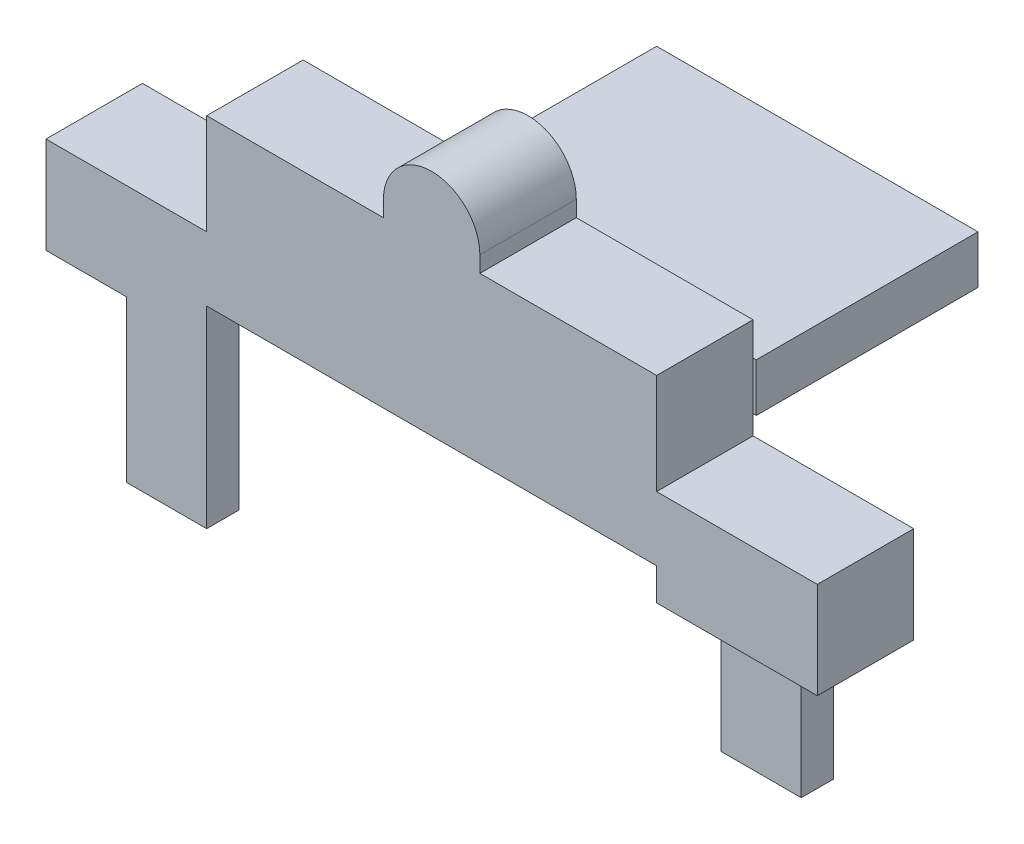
ISO-10303-21;
HEADER;
FILE_DESCRIPTION(('STEP AP214'),'2;1');
FILE_NAME('part.step','',(''),(''),'','','');
FILE_SCHEMA(('AUTOMOTIVE_DESIGN { 1 0 10303 214 1 1 1 1 }'));
ENDSEC;
DATA;
#1=APPLICATION_CONTEXT('core data for automotive mechanical design processes');
#2=APPLICATION_PROTOCOL_DEFINITION('international standard','automotive_design',2000,#1);
#3=PRODUCT_CONTEXT('',#1,'mechanical');
#4=PRODUCT('Part','Part','',(#3));
#5=PRODUCT_RELATED_PRODUCT_CATEGORY('part','',(#4));
#6=PRODUCT_DEFINITION_FORMATION('','',#4);
#7=PRODUCT_DEFINITION_CONTEXT('part definition',#1,'design');
#8=PRODUCT_DEFINITION('design','',#6,#7);
#9=PRODUCT_DEFINITION_SHAPE('','',#8);
#10=(LENGTH_UNIT() NAMED_UNIT(*) SI_UNIT(.MILLI.,.METRE.));
#11=(NAMED_UNIT(*) PLANE_ANGLE_UNIT() SI_UNIT($,.RADIAN.));
#12=(NAMED_UNIT(*) SI_UNIT($,.STERADIAN.) SOLID_ANGLE_UNIT());
#13=UNCERTAINTY_MEASURE_WITH_UNIT(LENGTH_MEASURE(1.E-05),#10,'distance_accuracy_value','');
#14=(GEOMETRIC_REPRESENTATION_CONTEXT(3) GLOBAL_UNCERTAINTY_ASSIGNED_CONTEXT((#13)) GLOBAL_UNIT_ASSIGNED_CONTEXT((#10,
#11,#12)) REPRESENTATION_CONTEXT('',''));
#15=CARTESIAN_POINT('',(0.,0.,0.));
#16=DIRECTION('',(0.,0.,1.));
#17=DIRECTION('',(1.,0.,0.));
#18=AXIS2_PLACEMENT_3D('',#15,#16,#17);
#19=CARTESIAN_POINT('',(0.,0.,0.));
#20=DIRECTION('',(0.,0.,1.));
#21=DIRECTION('',(1.,0.,0.));
#22=AXIS2_PLACEMENT_3D('',#19,#20,#21);
#23=PLANE('',#22);
#24=DIRECTION('',(0.,-1.,0.));
#25=VECTOR('',#24,1.);
#26=CARTESIAN_POINT('',(-9.85,10.,0.));
#27=LINE('',#26,#25);
#28=CARTESIAN_POINT('',(-9.85,2.,0.));
#29=VERTEX_POINT('',#28);
#30=CARTESIAN_POINT('',(-9.85,0.,0.));
#31=VERTEX_POINT('',#30);
#32=EDGE_CURVE('E50',#29,#31,#27,.T.);
#33=ORIENTED_EDGE('',*,*,#32,.T.);
#34=DIRECTION('',(-1.,0.,0.));
#35=VECTOR('',#34,1.);
#36=CARTESIAN_POINT('',(0.,0.,0.));
#37=LINE('',#36,#35);
#38=CARTESIAN_POINT('',(-14.,0.,0.));
#39=VERTEX_POINT('',#38);
#40=EDGE_CURVE('E261',#31,#39,#37,.T.);
#41=ORIENTED_EDGE('',*,*,#40,.T.);
#42=DIRECTION('',(0.,1.,0.));
#43=VECTOR('',#42,1.);
#44=CARTESIAN_POINT('',(-14.,-1.,0.));
#45=LINE('',#44,#43);
#46=CARTESIAN_POINT('',(-14.,-1.,0.));
#47=VERTEX_POINT('',#46);
#48=EDGE_CURVE('E380',#47,#39,#45,.T.);
#49=ORIENTED_EDGE('',*,*,#48,.F.);
#50=DIRECTION('',(1.,0.,0.));
#51=VECTOR('',#50,1.);
#52=CARTESIAN_POINT('',(0.,-1.,0.));
#53=LINE('',#52,#51);
#54=CARTESIAN_POINT('',(-19.,-1.,0.));
#55=VERTEX_POINT('',#54);
#56=EDGE_CURVE('E367',#55,#47,#53,.T.);
#57=ORIENTED_EDGE('',*,*,#56,.F.);
#58=DIRECTION('',(0.,1.,0.));
#59=VECTOR('',#58,1.);
#60=CARTESIAN_POINT('',(-19.,-1.,0.));
#61=LINE('',#60,#59);
#62=CARTESIAN_POINT('',(-19.,2.,0.));
#63=VERTEX_POINT('',#62);
#64=EDGE_CURVE('E383',#55,#63,#61,.T.);
#65=ORIENTED_EDGE('',*,*,#64,.T.);
#66=DIRECTION('',(1.,0.,0.));
#67=VECTOR('',#66,1.);
#68=CARTESIAN_POINT('',(0.,2.,0.));
#69=LINE('',#68,#67);
#70=CARTESIAN_POINT('',(-14.,2.,0.));
#71=VERTEX_POINT('',#70);
#72=EDGE_CURVE('E355',#63,#71,#69,.T.);
#73=ORIENTED_EDGE('',*,*,#72,.T.);
#74=DIRECTION('',(0.,1.,0.));
#75=VECTOR('',#74,1.);
#76=CARTESIAN_POINT('',(-14.,0.,0.));
#77=LINE('',#76,#75);
#78=CARTESIAN_POINT('',(-14.,5.13,0.));
#79=VERTEX_POINT('',#78);
#80=EDGE_CURVE('E429',#71,#79,#77,.T.);
#81=ORIENTED_EDGE('',*,*,#80,.T.);
#82=DIRECTION('',(1.,0.,0.));
#83=VECTOR('',#82,1.);
#84=CARTESIAN_POINT('',(0.,5.13,0.));
#85=LINE('',#84,#83);
#86=CARTESIAN_POINT('',(-8.5,5.13,0.));
#87=VERTEX_POINT('',#86);
#88=EDGE_CURVE('E421',#79,#87,#85,.T.);
#89=ORIENTED_EDGE('',*,*,#88,.T.);
#90=DIRECTION('',(0.,-1.,0.));
#91=VECTOR('',#90,1.);
#92=CARTESIAN_POINT('',(-8.5,0.,0.));
#93=LINE('',#92,#91);
#94=CARTESIAN_POINT('',(-8.5,5.63,0.));
#95=VERTEX_POINT('',#94);
#96=EDGE_CURVE('E426',#95,#87,#93,.T.);
#97=ORIENTED_EDGE('',*,*,#96,.F.);
#98=CARTESIAN_POINT('',(-7.,5.63,0.));
#99=DIRECTION('',(0.,0.,1.));
#100=DIRECTION('',(1.,0.,0.));
#101=AXIS2_PLACEMENT_3D('',#98,#99,#100);
#102=CIRCLE('',#101,1.5);
#103=CARTESIAN_POINT('',(-5.5,5.63,0.));
#104=VERTEX_POINT('',#103);
#105=EDGE_CURVE('E424',#104,#95,#102,.T.);
#106=ORIENTED_EDGE('',*,*,#105,.F.);
#107=DIRECTION('',(0.,-1.,0.));
#108=VECTOR('',#107,1.);
#109=CARTESIAN_POINT('',(-5.5,0.,0.));
#110=LINE('',#109,#108);
#111=CARTESIAN_POINT('',(-5.5,5.13,0.));
#112=VERTEX_POINT('',#111);
#113=EDGE_CURVE('E420',#104,#112,#110,.T.);
#114=ORIENTED_EDGE('',*,*,#113,.T.);
#115=CARTESIAN_POINT('',(0.,5.13,0.));
#116=VERTEX_POINT('',#115);
#117=EDGE_CURVE('E397',#112,#116,#85,.T.);
#118=ORIENTED_EDGE('',*,*,#117,.T.);
#119=DIRECTION('',(0.,-1.,0.));
#120=VECTOR('',#119,1.);
#121=CARTESIAN_POINT('',(0.,0.,0.));
#122=LINE('',#121,#120);
#123=CARTESIAN_POINT('',(0.,2.,0.));
#124=VERTEX_POINT('',#123);
#125=EDGE_CURVE('E404',#116,#124,#122,.T.);
#126=ORIENTED_EDGE('',*,*,#125,.T.);
#127=DIRECTION('',(1.,0.,0.));
#128=VECTOR('',#127,1.);
#129=CARTESIAN_POINT('',(0.,2.,0.));
#130=LINE('',#129,#128);
#131=CARTESIAN_POINT('',(5.,2.,0.));
#132=VERTEX_POINT('',#131);
#133=EDGE_CURVE('E329',#124,#132,#130,.T.);
#134=ORIENTED_EDGE('',*,*,#133,.T.);
#135=DIRECTION('',(0.,1.,0.));
#136=VECTOR('',#135,1.);
#137=CARTESIAN_POINT('',(5.,-0.999999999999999,0.));
#138=LINE('',#137,#136);
#139=CARTESIAN_POINT('',(5.,-0.999999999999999,0.));
#140=VERTEX_POINT('',#139);
#141=EDGE_CURVE('E342',#140,#132,#138,.T.);
#142=ORIENTED_EDGE('',*,*,#141,.F.);
#143=DIRECTION('',(1.,0.,0.));
#144=VECTOR('',#143,1.);
#145=CARTESIAN_POINT('',(0.,-1.,0.));
#146=LINE('',#145,#144);
#147=CARTESIAN_POINT('',(2.5,-1.,0.));
#148=VERTEX_POINT('',#147);
#149=EDGE_CURVE('E340',#148,#140,#146,.T.);
#150=ORIENTED_EDGE('',*,*,#149,.F.);
#151=DIRECTION('',(0.,1.,0.));
#152=VECTOR('',#151,1.);
#153=CARTESIAN_POINT('',(2.5,-6.,0.));
#154=LINE('',#153,#152);
#155=CARTESIAN_POINT('',(2.5,-6.,0.));
#156=VERTEX_POINT('',#155);
#157=EDGE_CURVE('E300',#156,#148,#154,.T.);
#158=ORIENTED_EDGE('',*,*,#157,.F.);
#159=DIRECTION('',(1.,0.,0.));
#160=VECTOR('',#159,1.);
#161=CARTESIAN_POINT('',(0.,-6.,0.));
#162=LINE('',#161,#160);
#163=CARTESIAN_POINT('',(0.,-6.,0.));
#164=VERTEX_POINT('',#163);
#165=EDGE_CURVE('E289',#164,#156,#162,.T.);
#166=ORIENTED_EDGE('',*,*,#165,.F.);
#167=DIRECTION('',(0.,1.,0.));
#168=VECTOR('',#167,1.);
#169=CARTESIAN_POINT('',(0.,-1.,0.));
#170=LINE('',#169,#168);
#171=CARTESIAN_POINT('',(0.,0.,0.));
#172=VERTEX_POINT('',#171);
#173=EDGE_CURVE('E344',#164,#172,#170,.T.);
#174=ORIENTED_EDGE('',*,*,#173,.T.);
#175=CARTESIAN_POINT('',(-4.15,0.,0.));
#176=VERTEX_POINT('',#175);
#177=EDGE_CURVE('E431',#172,#176,#37,.T.);
#178=ORIENTED_EDGE('',*,*,#177,.T.);
#179=DIRECTION('',(0.,-1.,0.));
#180=VECTOR('',#179,1.);
#181=CARTESIAN_POINT('',(-4.15,10.,0.));
#182=LINE('',#181,#180);
#183=CARTESIAN_POINT('',(-4.15,2.,0.));
#184=VERTEX_POINT('',#183);
#185=EDGE_CURVE('E58',#184,#176,#182,.T.);
#186=ORIENTED_EDGE('',*,*,#185,.F.);
#187=DIRECTION('',(1.,0.,0.));
#188=VECTOR('',#187,1.);
#189=CARTESIAN_POINT('',(0.,2.,0.));
#190=LINE('',#189,#188);
#191=EDGE_CURVE('E454',#29,#184,#190,.T.);
#192=ORIENTED_EDGE('',*,*,#191,.F.);
#193=EDGE_LOOP('',(#33,#41,#49,#57,#65,#73,#81,#89,#97,#106,#114,#118,#126,#134,#142,#150,#158,
#166,#174,#178,#186,#192));
#194=FACE_BOUND('',#193,.T.);
#195=ADVANCED_FACE('F35',(#194),#23,.F.);
#196=CARTESIAN_POINT('',(0.,0.5,0.));
#197=DIRECTION('',(0.,-1.,0.));
#198=DIRECTION('',(1.,0.,0.));
#199=AXIS2_PLACEMENT_3D('',#196,#197,#198);
#200=PLANE('',#199);
#201=DIRECTION('',(-1.,0.,0.));
#202=VECTOR('',#201,1.);
#203=CARTESIAN_POINT('',(-2.,0.5,-2.1));
#204=LINE('',#203,#202);
#205=CARTESIAN_POINT('',(-2.,0.5,-2.1));
#206=VERTEX_POINT('',#205);
#207=CARTESIAN_POINT('',(-4.15,0.5,-2.1));
#208=VERTEX_POINT('',#207);
#209=EDGE_CURVE('E272',#206,#208,#204,.T.);
#210=ORIENTED_EDGE('',*,*,#209,.T.);
#211=DIRECTION('',(1.,0.,0.));
#212=VECTOR('',#211,1.);
#213=CARTESIAN_POINT('',(-9.85,0.499999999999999,-2.1));
#214=LINE('',#213,#212);
#215=CARTESIAN_POINT('',(-9.85,0.499999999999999,-2.1));
#216=VERTEX_POINT('',#215);
#217=EDGE_CURVE('E257',#216,#208,#214,.T.);
#218=ORIENTED_EDGE('',*,*,#217,.F.);
#219=DIRECTION('',(-1.,0.,0.));
#220=VECTOR('',#219,1.);
#221=CARTESIAN_POINT('',(-12.,0.499999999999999,-2.1));
#222=LINE('',#221,#220);
#223=CARTESIAN_POINT('',(-12.,0.499999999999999,-2.1));
#224=VERTEX_POINT('',#223);
#225=EDGE_CURVE('E11',#216,#224,#222,.T.);
#226=ORIENTED_EDGE('',*,*,#225,.T.);
#227=DIRECTION('',(0.,0.,-1.));
#228=VECTOR('',#227,1.);
#229=CARTESIAN_POINT('',(-12.,0.499999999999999,0.));
#230=LINE('',#229,#228);
#231=CARTESIAN_POINT('',(-12.,0.499999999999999,-9.));
#232=VERTEX_POINT('',#231);
#233=EDGE_CURVE('E266',#224,#232,#230,.T.);
#234=ORIENTED_EDGE('',*,*,#233,.T.);
#235=DIRECTION('',(1.,0.,0.));
#236=VECTOR('',#235,1.);
#237=CARTESIAN_POINT('',(-12.,0.499999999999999,-9.));
#238=LINE('',#237,#236);
#239=CARTESIAN_POINT('',(-2.,0.5,-9.));
#240=VERTEX_POINT('',#239);
#241=EDGE_CURVE('E268',#232,#240,#238,.T.);
#242=ORIENTED_EDGE('',*,*,#241,.T.);
#243=DIRECTION('',(0.,0.,1.));
#244=VECTOR('',#243,1.);
#245=CARTESIAN_POINT('',(-2.,0.5,0.));
#246=LINE('',#245,#244);
#247=EDGE_CURVE('E270',#240,#206,#246,.T.);
#248=ORIENTED_EDGE('',*,*,#247,.T.);
#249=EDGE_LOOP('',(#210,#218,#226,#234,#242,#248));
#250=FACE_BOUND('',#249,.T.);
#251=ADVANCED_FACE('F502',(#250),#200,.T.);
#252=CARTESIAN_POINT('',(-12.,2.,3.));
#253=DIRECTION('',(-1.,0.,0.));
#254=DIRECTION('',(0.,-1.,0.));
#255=AXIS2_PLACEMENT_3D('',#252,#253,#254);
#256=PLANE('',#255);
#257=DIRECTION('',(0.,-1.,0.));
#258=VECTOR('',#257,1.);
#259=CARTESIAN_POINT('',(-12.,2.,-9.));
#260=LINE('',#259,#258);
#261=CARTESIAN_POINT('',(-12.,2.,-9.));
#262=VERTEX_POINT('',#261);
#263=EDGE_CURVE('E393',#262,#232,#260,.T.);
#264=ORIENTED_EDGE('',*,*,#263,.T.);
#265=ORIENTED_EDGE('',*,*,#233,.F.);
#266=DIRECTION('',(0.,-1.,0.));
#267=VECTOR('',#266,1.);
#268=CARTESIAN_POINT('',(-12.,10.,-2.1));
#269=LINE('',#268,#267);
#270=CARTESIAN_POINT('',(-12.,2.,-2.1));
#271=VERTEX_POINT('',#270);
#272=EDGE_CURVE('E277',#271,#224,#269,.T.);
#273=ORIENTED_EDGE('',*,*,#272,.F.);
#274=DIRECTION('',(0.,0.,-1.));
#275=VECTOR('',#274,1.);
#276=CARTESIAN_POINT('',(-12.,2.,3.));
#277=LINE('',#276,#275);
#278=EDGE_CURVE('E385',#271,#262,#277,.T.);
#279=ORIENTED_EDGE('',*,*,#278,.T.);
#280=EDGE_LOOP('',(#264,#265,#273,#279));
#281=FACE_BOUND('',#280,.T.);
#282=ADVANCED_FACE('F496',(#281),#256,.T.);
#283=CARTESIAN_POINT('',(-2.,2.,3.));
#284=DIRECTION('',(1.,0.,0.));
#285=DIRECTION('',(0.,1.,0.));
#286=AXIS2_PLACEMENT_3D('',#283,#284,#285);
#287=PLANE('',#286);
#288=DIRECTION('',(0.,-1.,0.));
#289=VECTOR('',#288,1.);
#290=CARTESIAN_POINT('',(-2.,10.,-2.1));
#291=LINE('',#290,#289);
#292=CARTESIAN_POINT('',(-2.,2.,-2.1));
#293=VERTEX_POINT('',#292);
#294=EDGE_CURVE('E280',#293,#206,#291,.T.);
#295=ORIENTED_EDGE('',*,*,#294,.T.);
#296=ORIENTED_EDGE('',*,*,#247,.F.);
#297=DIRECTION('',(0.,-1.,0.));
#298=VECTOR('',#297,1.);
#299=CARTESIAN_POINT('',(-2.,2.,-9.));
#300=LINE('',#299,#298);
#301=CARTESIAN_POINT('',(-2.,2.,-9.));
#302=VERTEX_POINT('',#301);
#303=EDGE_CURVE('E394',#302,#240,#300,.T.);
#304=ORIENTED_EDGE('',*,*,#303,.F.);
#305=DIRECTION('',(0.,0.,1.));
#306=VECTOR('',#305,1.);
#307=CARTESIAN_POINT('',(-2.,2.,3.));
#308=LINE('',#307,#306);
#309=EDGE_CURVE('E390',#302,#293,#308,.T.);
#310=ORIENTED_EDGE('',*,*,#309,.T.);
#311=EDGE_LOOP('',(#295,#296,#304,#310));
#312=FACE_BOUND('',#311,.T.);
#313=ADVANCED_FACE('F488',(#312),#287,.T.);
#314=CARTESIAN_POINT('',(-12.,2.,-9.));
#315=DIRECTION('',(0.,0.,-1.));
#316=DIRECTION('',(-1.,0.,0.));
#317=AXIS2_PLACEMENT_3D('',#314,#315,#316);
#318=PLANE('',#317);
#319=ORIENTED_EDGE('',*,*,#303,.T.);
#320=ORIENTED_EDGE('',*,*,#241,.F.);
#321=ORIENTED_EDGE('',*,*,#263,.F.);
#322=DIRECTION('',(1.,0.,0.));
#323=VECTOR('',#322,1.);
#324=CARTESIAN_POINT('',(-12.,2.,-9.));
#325=LINE('',#324,#323);
#326=EDGE_CURVE('E387',#262,#302,#325,.T.);
#327=ORIENTED_EDGE('',*,*,#326,.T.);
#328=EDGE_LOOP('',(#319,#320,#321,#327));
#329=FACE_BOUND('',#328,.T.);
#330=ADVANCED_FACE('F492',(#329),#318,.T.);
#331=CARTESIAN_POINT('',(-2.,10.,-2.1));
#332=DIRECTION('',(0.,0.,-1.));
#333=DIRECTION('',(-1.,0.,0.));
#334=AXIS2_PLACEMENT_3D('',#331,#332,#333);
#335=PLANE('',#334);
#336=ORIENTED_EDGE('',*,*,#209,.F.);
#337=ORIENTED_EDGE('',*,*,#294,.F.);
#338=DIRECTION('',(1.,0.,0.));
#339=VECTOR('',#338,1.);
#340=CARTESIAN_POINT('',(0.,2.,-2.1));
#341=LINE('',#340,#339);
#342=CARTESIAN_POINT('',(-4.15,2.,-2.1));
#343=VERTEX_POINT('',#342);
#344=EDGE_CURVE('E472',#343,#293,#341,.T.);
#345=ORIENTED_EDGE('',*,*,#344,.F.);
#346=DIRECTION('',(0.,-1.,0.));
#347=VECTOR('',#346,1.);
#348=CARTESIAN_POINT('',(-4.15,10.,-2.1));
#349=LINE('',#348,#347);
#350=EDGE_CURVE('E283',#343,#208,#349,.T.);
#351=ORIENTED_EDGE('',*,*,#350,.T.);
#352=EDGE_LOOP('',(#336,#337,#345,#351));
#353=FACE_BOUND('',#352,.T.);
#354=ADVANCED_FACE('F658',(#353),#335,.F.);
#355=CARTESIAN_POINT('',(-4.15,10.,0.));
#356=DIRECTION('',(-1.,0.,0.));
#357=DIRECTION('',(0.,-1.,0.));
#358=AXIS2_PLACEMENT_3D('',#355,#356,#357);
#359=PLANE('',#358);
#360=ORIENTED_EDGE('',*,*,#185,.T.);
#361=DIRECTION('',(0.,0.,1.));
#362=VECTOR('',#361,1.);
#363=CARTESIAN_POINT('',(-4.15,0.,0.));
#364=LINE('',#363,#362);
#365=CARTESIAN_POINT('',(-4.15,0.,-2.1));
#366=VERTEX_POINT('',#365);
#367=EDGE_CURVE('E248',#366,#176,#364,.T.);
#368=ORIENTED_EDGE('',*,*,#367,.F.);
#369=DIRECTION('',(0.,1.,0.));
#370=VECTOR('',#369,1.);
#371=CARTESIAN_POINT('',(-4.15,-6.07453701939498,-2.1));
#372=LINE('',#371,#370);
#373=EDGE_CURVE('E244',#366,#208,#372,.T.);
#374=ORIENTED_EDGE('',*,*,#373,.T.);
#375=ORIENTED_EDGE('',*,*,#350,.F.);
#376=DIRECTION('',(0.,0.,-1.));
#377=VECTOR('',#376,1.);
#378=CARTESIAN_POINT('',(-4.15,2.,0.));
#379=LINE('',#378,#377);
#380=EDGE_CURVE('E469',#184,#343,#379,.T.);
#381=ORIENTED_EDGE('',*,*,#380,.F.);
#382=EDGE_LOOP('',(#360,#368,#374,#375,#381));
#383=FACE_BOUND('',#382,.T.);
#384=ADVANCED_FACE('F483',(#383),#359,.F.);
#385=CARTESIAN_POINT('',(-9.85,10.,0.));
#386=DIRECTION('',(1.,0.,0.));
#387=DIRECTION('',(0.,1.,0.));
#388=AXIS2_PLACEMENT_3D('',#385,#386,#387);
#389=PLANE('',#388);
#390=DIRECTION('',(0.,-1.,0.));
#391=VECTOR('',#390,1.);
#392=CARTESIAN_POINT('',(-9.85,10.,-2.1));
#393=LINE('',#392,#391);
#394=CARTESIAN_POINT('',(-9.85,2.,-2.1));
#395=VERTEX_POINT('',#394);
#396=EDGE_CURVE('E256',#395,#216,#393,.T.);
#397=ORIENTED_EDGE('',*,*,#396,.T.);
#398=DIRECTION('',(0.,1.,0.));
#399=VECTOR('',#398,1.);
#400=CARTESIAN_POINT('',(-9.85,-6.07453701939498,-2.1));
#401=LINE('',#400,#399);
#402=CARTESIAN_POINT('',(-9.85,0.,-2.1));
#403=VERTEX_POINT('',#402);
#404=EDGE_CURVE('E242',#403,#216,#401,.T.);
#405=ORIENTED_EDGE('',*,*,#404,.F.);
#406=DIRECTION('',(0.,0.,-1.));
#407=VECTOR('',#406,1.);
#408=CARTESIAN_POINT('',(-9.85,0.,0.));
#409=LINE('',#408,#407);
#410=EDGE_CURVE('E249',#31,#403,#409,.T.);
#411=ORIENTED_EDGE('',*,*,#410,.F.);
#412=ORIENTED_EDGE('',*,*,#32,.F.);
#413=DIRECTION('',(0.,0.,1.));
#414=VECTOR('',#413,1.);
#415=CARTESIAN_POINT('',(-9.85,2.,0.));
#416=LINE('',#415,#414);
#417=EDGE_CURVE('E43',#395,#29,#416,.T.);
#418=ORIENTED_EDGE('',*,*,#417,.F.);
#419=EDGE_LOOP('',(#397,#405,#411,#412,#418));
#420=FACE_BOUND('',#419,.T.);
#421=ADVANCED_FACE('F254',(#420),#389,.F.);
#422=CARTESIAN_POINT('',(-12.,10.,-2.1));
#423=DIRECTION('',(0.,0.,-1.));
#424=DIRECTION('',(-1.,0.,0.));
#425=AXIS2_PLACEMENT_3D('',#422,#423,#424);
#426=PLANE('',#425);
#427=ORIENTED_EDGE('',*,*,#225,.F.);
#428=ORIENTED_EDGE('',*,*,#396,.F.);
#429=DIRECTION('',(1.,0.,0.));
#430=VECTOR('',#429,1.);
#431=CARTESIAN_POINT('',(0.,2.,-2.1));
#432=LINE('',#431,#430);
#433=EDGE_CURVE('E475',#271,#395,#432,.T.);
#434=ORIENTED_EDGE('',*,*,#433,.F.);
#435=ORIENTED_EDGE('',*,*,#272,.T.);
#436=EDGE_LOOP('',(#427,#428,#434,#435));
#437=FACE_BOUND('',#436,.T.);
#438=ADVANCED_FACE('F500',(#437),#426,.F.);
#439=CARTESIAN_POINT('',(0.,-1.,0.));
#440=DIRECTION('',(0.,-1.,0.));
#441=DIRECTION('',(1.,0.,0.));
#442=AXIS2_PLACEMENT_3D('',#439,#440,#441);
#443=PLANE('',#442);
#444=DIRECTION('',(1.,0.,0.));
#445=VECTOR('',#444,1.);
#446=CARTESIAN_POINT('',(0.,-1.,1.));
#447=LINE('',#446,#445);
#448=CARTESIAN_POINT('',(0.,-1.,1.));
#449=VERTEX_POINT('',#448);
#450=CARTESIAN_POINT('',(2.5,-1.,1.));
#451=VERTEX_POINT('',#450);
#452=EDGE_CURVE('E463',#449,#451,#447,.T.);
#453=ORIENTED_EDGE('',*,*,#452,.T.);
#454=DIRECTION('',(0.,0.,-1.));
#455=VECTOR('',#454,1.);
#456=CARTESIAN_POINT('',(2.5,-1.,0.));
#457=LINE('',#456,#455);
#458=EDGE_CURVE('E466',#451,#148,#457,.T.);
#459=ORIENTED_EDGE('',*,*,#458,.T.);
#460=ORIENTED_EDGE('',*,*,#149,.T.);
#461=DIRECTION('',(0.,0.,-1.));
#462=VECTOR('',#461,1.);
#463=CARTESIAN_POINT('',(5.,-0.999999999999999,0.));
#464=LINE('',#463,#462);
#465=CARTESIAN_POINT('',(5.,-0.999999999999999,3.));
#466=VERTEX_POINT('',#465);
#467=EDGE_CURVE('E332',#466,#140,#464,.T.);
#468=ORIENTED_EDGE('',*,*,#467,.F.);
#469=DIRECTION('',(1.,0.,0.));
#470=VECTOR('',#469,1.);
#471=CARTESIAN_POINT('',(0.,-1.,3.));
#472=LINE('',#471,#470);
#473=CARTESIAN_POINT('',(0.,-1.,3.));
#474=VERTEX_POINT('',#473);
#475=EDGE_CURVE('E335',#474,#466,#472,.T.);
#476=ORIENTED_EDGE('',*,*,#475,.F.);
#477=DIRECTION('',(0.,0.,1.));
#478=VECTOR('',#477,1.);
#479=CARTESIAN_POINT('',(0.,-1.,0.));
#480=LINE('',#479,#478);
#481=EDGE_CURVE('E338',#449,#474,#480,.T.);
#482=ORIENTED_EDGE('',*,*,#481,.F.);
#483=EDGE_LOOP('',(#453,#459,#460,#468,#476,#482));
#484=FACE_BOUND('',#483,.T.);
#485=ADVANCED_FACE('F518',(#484),#443,.T.);
#486=CARTESIAN_POINT('',(0.,-1.,0.));
#487=DIRECTION('',(0.,-1.,0.));
#488=DIRECTION('',(1.,0.,0.));
#489=AXIS2_PLACEMENT_3D('',#486,#487,#488);
#490=PLANE('',#489);
#491=DIRECTION('',(-1.,0.,0.));
#492=VECTOR('',#491,1.);
#493=CARTESIAN_POINT('',(0.,-1.,2.));
#494=LINE('',#493,#492);
#495=CARTESIAN_POINT('',(-14.,-1.,2.));
#496=VERTEX_POINT('',#495);
#497=CARTESIAN_POINT('',(-16.5,-1.,2.));
#498=VERTEX_POINT('',#497);
#499=EDGE_CURVE('E457',#496,#498,#494,.T.);
#500=ORIENTED_EDGE('',*,*,#499,.T.);
#501=DIRECTION('',(0.,0.,1.));
#502=VECTOR('',#501,1.);
#503=CARTESIAN_POINT('',(-16.5,-1.,0.));
#504=LINE('',#503,#502);
#505=CARTESIAN_POINT('',(-16.5,-1.,3.));
#506=VERTEX_POINT('',#505);
#507=EDGE_CURVE('E460',#498,#506,#504,.T.);
#508=ORIENTED_EDGE('',*,*,#507,.T.);
#509=DIRECTION('',(1.,0.,0.));
#510=VECTOR('',#509,1.);
#511=CARTESIAN_POINT('',(0.,-1.,3.));
#512=LINE('',#511,#510);
#513=CARTESIAN_POINT('',(-19.,-1.,3.));
#514=VERTEX_POINT('',#513);
#515=EDGE_CURVE('E372',#514,#506,#512,.T.);
#516=ORIENTED_EDGE('',*,*,#515,.F.);
#517=DIRECTION('',(0.,0.,-1.));
#518=VECTOR('',#517,1.);
#519=CARTESIAN_POINT('',(-19.,-1.,0.));
#520=LINE('',#519,#518);
#521=EDGE_CURVE('E364',#514,#55,#520,.T.);
#522=ORIENTED_EDGE('',*,*,#521,.T.);
#523=ORIENTED_EDGE('',*,*,#56,.T.);
#524=DIRECTION('',(0.,0.,-1.));
#525=VECTOR('',#524,1.);
#526=CARTESIAN_POINT('',(-14.,-1.,0.));
#527=LINE('',#526,#525);
#528=EDGE_CURVE('E370',#496,#47,#527,.T.);
#529=ORIENTED_EDGE('',*,*,#528,.F.);
#530=EDGE_LOOP('',(#500,#508,#516,#522,#523,#529));
#531=FACE_BOUND('',#530,.T.);
#532=ADVANCED_FACE('F572',(#531),#490,.T.);
#533=CARTESIAN_POINT('',(0.,5.13,3.));
#534=DIRECTION('',(0.,1.,0.));
#535=DIRECTION('',(-1.,0.,0.));
#536=AXIS2_PLACEMENT_3D('',#533,#534,#535);
#537=PLANE('',#536);
#538=ORIENTED_EDGE('',*,*,#117,.F.);
#539=DIRECTION('',(0.,0.,-1.));
#540=VECTOR('',#539,1.);
#541=CARTESIAN_POINT('',(-5.5,5.13,3.));
#542=LINE('',#541,#540);
#543=CARTESIAN_POINT('',(-5.5,5.13,3.));
#544=VERTEX_POINT('',#543);
#545=EDGE_CURVE('E452',#544,#112,#542,.T.);
#546=ORIENTED_EDGE('',*,*,#545,.F.);
#547=DIRECTION('',(1.,0.,0.));
#548=VECTOR('',#547,1.);
#549=CARTESIAN_POINT('',(0.,5.13,3.));
#550=LINE('',#549,#548);
#551=CARTESIAN_POINT('',(0.,5.13,3.));
#552=VERTEX_POINT('',#551);
#553=EDGE_CURVE('E400',#544,#552,#550,.T.);
#554=ORIENTED_EDGE('',*,*,#553,.T.);
#555=DIRECTION('',(0.,0.,-1.));
#556=VECTOR('',#555,1.);
#557=CARTESIAN_POINT('',(0.,5.13,3.));
#558=LINE('',#557,#556);
#559=EDGE_CURVE('E418',#552,#116,#558,.T.);
#560=ORIENTED_EDGE('',*,*,#559,.T.);
#561=EDGE_LOOP('',(#538,#546,#554,#560));
#562=FACE_BOUND('',#561,.T.);
#563=ADVANCED_FACE('F536',(#562),#537,.T.);
#564=CARTESIAN_POINT('',(-5.5,0.,3.));
#565=DIRECTION('',(1.,0.,0.));
#566=DIRECTION('',(0.,0.,-1.));
#567=AXIS2_PLACEMENT_3D('',#564,#565,#566);
#568=PLANE('',#567);
#569=ORIENTED_EDGE('',*,*,#113,.F.);
#570=DIRECTION('',(0.,0.,-1.));
#571=VECTOR('',#570,1.);
#572=CARTESIAN_POINT('',(-5.5,5.63,3.));
#573=LINE('',#572,#571);
#574=CARTESIAN_POINT('',(-5.5,5.63,3.));
#575=VERTEX_POINT('',#574);
#576=EDGE_CURVE('E450',#575,#104,#573,.T.);
#577=ORIENTED_EDGE('',*,*,#576,.F.);
#578=DIRECTION('',(0.,-1.,0.));
#579=VECTOR('',#578,1.);
#580=CARTESIAN_POINT('',(-5.5,0.,3.));
#581=LINE('',#580,#579);
#582=EDGE_CURVE('E403',#575,#544,#581,.T.);
#583=ORIENTED_EDGE('',*,*,#582,.T.);
#584=ORIENTED_EDGE('',*,*,#545,.T.);
#585=EDGE_LOOP('',(#569,#577,#583,#584));
#586=FACE_BOUND('',#585,.T.);
#587=ADVANCED_FACE('F37',(#586),#568,.T.);
#588=CARTESIAN_POINT('',(-7.,5.63,3.));
#589=DIRECTION('',(0.,0.,-1.));
#590=DIRECTION('',(-1.,0.,0.));
#591=AXIS2_PLACEMENT_3D('',#588,#589,#590);
#592=CYLINDRICAL_SURFACE('',#591,1.5);
#593=ORIENTED_EDGE('',*,*,#105,.T.);
#594=DIRECTION('',(0.,0.,-1.));
#595=VECTOR('',#594,1.);
#596=CARTESIAN_POINT('',(-8.5,5.63,3.));
#597=LINE('',#596,#595);
#598=CARTESIAN_POINT('',(-8.5,5.63,3.));
#599=VERTEX_POINT('',#598);
#600=EDGE_CURVE('E447',#599,#95,#597,.T.);
#601=ORIENTED_EDGE('',*,*,#600,.F.);
#602=CARTESIAN_POINT('',(-7.,5.63,3.));
#603=DIRECTION('',(0.,0.,1.));
#604=DIRECTION('',(1.,0.,0.));
#605=AXIS2_PLACEMENT_3D('',#602,#603,#604);
#606=CIRCLE('',#605,1.5);
#607=EDGE_CURVE('E408',#575,#599,#606,.T.);
#608=ORIENTED_EDGE('',*,*,#607,.F.);
#609=ORIENTED_EDGE('',*,*,#576,.T.);
#610=EDGE_LOOP('',(#593,#601,#608,#609));
#611=FACE_BOUND('',#610,.T.);
#612=ADVANCED_FACE('F543',(#611),#592,.T.);
#613=CARTESIAN_POINT('',(-8.5,0.,3.));
#614=DIRECTION('',(1.,0.,0.));
#615=DIRECTION('',(0.,0.,-1.));
#616=AXIS2_PLACEMENT_3D('',#613,#614,#615);
#617=PLANE('',#616);
#618=ORIENTED_EDGE('',*,*,#96,.T.);
#619=DIRECTION('',(0.,0.,-1.));
#620=VECTOR('',#619,1.);
#621=CARTESIAN_POINT('',(-8.5,5.13,3.));
#622=LINE('',#621,#620);
#623=CARTESIAN_POINT('',(-8.5,5.13,3.));
#624=VERTEX_POINT('',#623);
#625=EDGE_CURVE('E444',#624,#87,#622,.T.);
#626=ORIENTED_EDGE('',*,*,#625,.F.);
#627=DIRECTION('',(0.,-1.,0.));
#628=VECTOR('',#627,1.);
#629=CARTESIAN_POINT('',(-8.5,0.,3.));
#630=LINE('',#629,#628);
#631=EDGE_CURVE('E410',#599,#624,#630,.T.);
#632=ORIENTED_EDGE('',*,*,#631,.F.);
#633=ORIENTED_EDGE('',*,*,#600,.T.);
#634=EDGE_LOOP('',(#618,#626,#632,#633));
#635=FACE_BOUND('',#634,.T.);
#636=ADVANCED_FACE('F550',(#635),#617,.F.);
#637=ORIENTED_EDGE('',*,*,#88,.F.);
#638=DIRECTION('',(0.,0.,-1.));
#639=VECTOR('',#638,1.);
#640=CARTESIAN_POINT('',(-14.,5.13,3.));
#641=LINE('',#640,#639);
#642=CARTESIAN_POINT('',(-14.,5.13,3.));
#643=VERTEX_POINT('',#642);
#644=EDGE_CURVE('E441',#643,#79,#641,.T.);
#645=ORIENTED_EDGE('',*,*,#644,.F.);
#646=EDGE_CURVE('E405',#643,#624,#550,.T.);
#647=ORIENTED_EDGE('',*,*,#646,.T.);
#648=ORIENTED_EDGE('',*,*,#625,.T.);
#649=EDGE_LOOP('',(#637,#645,#647,#648));
#650=FACE_BOUND('',#649,.T.);
#651=ADVANCED_FACE('F555',(#650),#537,.T.);
#652=CARTESIAN_POINT('',(-14.,0.,3.));
#653=DIRECTION('',(-1.,0.,0.));
#654=DIRECTION('',(0.,0.,1.));
#655=AXIS2_PLACEMENT_3D('',#652,#653,#654);
#656=PLANE('',#655);
#657=DIRECTION('',(0.,0.,-1.));
#658=VECTOR('',#657,1.);
#659=CARTESIAN_POINT('',(-14.,2.,0.));
#660=LINE('',#659,#658);
#661=CARTESIAN_POINT('',(-14.,2.,3.));
#662=VERTEX_POINT('',#661);
#663=EDGE_CURVE('E358',#662,#71,#660,.T.);
#664=ORIENTED_EDGE('',*,*,#663,.F.);
#665=DIRECTION('',(0.,1.,0.));
#666=VECTOR('',#665,1.);
#667=CARTESIAN_POINT('',(-14.,0.,3.));
#668=LINE('',#667,#666);
#669=EDGE_CURVE('E412',#662,#643,#668,.T.);
#670=ORIENTED_EDGE('',*,*,#669,.T.);
#671=ORIENTED_EDGE('',*,*,#644,.T.);
#672=ORIENTED_EDGE('',*,*,#80,.F.);
#673=EDGE_LOOP('',(#664,#670,#671,#672));
#674=FACE_BOUND('',#673,.T.);
#675=ADVANCED_FACE('F557',(#674),#656,.T.);
#676=CARTESIAN_POINT('',(0.,0.,3.));
#677=DIRECTION('',(0.,-1.,0.));
#678=DIRECTION('',(1.,0.,0.));
#679=AXIS2_PLACEMENT_3D('',#676,#677,#678);
#680=PLANE('',#679);
#681=DIRECTION('',(0.,0.,-1.));
#682=VECTOR('',#681,1.);
#683=CARTESIAN_POINT('',(-14.,0.,3.));
#684=LINE('',#683,#682);
#685=CARTESIAN_POINT('',(-14.,0.,3.));
#686=VERTEX_POINT('',#685);
#687=EDGE_CURVE('E439',#686,#39,#684,.T.);
#688=ORIENTED_EDGE('',*,*,#687,.T.);
#689=ORIENTED_EDGE('',*,*,#40,.F.);
#690=ORIENTED_EDGE('',*,*,#410,.T.);
#691=DIRECTION('',(1.,0.,0.));
#692=VECTOR('',#691,1.);
#693=CARTESIAN_POINT('',(-9.85,0.,-2.1));
#694=LINE('',#693,#692);
#695=EDGE_CURVE('E238',#403,#366,#694,.T.);
#696=ORIENTED_EDGE('',*,*,#695,.T.);
#697=ORIENTED_EDGE('',*,*,#367,.T.);
#698=ORIENTED_EDGE('',*,*,#177,.F.);
#699=DIRECTION('',(0.,0.,-1.));
#700=VECTOR('',#699,1.);
#701=CARTESIAN_POINT('',(0.,0.,3.));
#702=LINE('',#701,#700);
#703=CARTESIAN_POINT('',(0.,0.,3.));
#704=VERTEX_POINT('',#703);
#705=EDGE_CURVE('E437',#704,#172,#702,.T.);
#706=ORIENTED_EDGE('',*,*,#705,.F.);
#707=DIRECTION('',(-1.,0.,0.));
#708=VECTOR('',#707,1.);
#709=CARTESIAN_POINT('',(0.,0.,3.));
#710=LINE('',#709,#708);
#711=EDGE_CURVE('E414',#704,#686,#710,.T.);
#712=ORIENTED_EDGE('',*,*,#711,.T.);
#713=EDGE_LOOP('',(#688,#689,#690,#696,#697,#698,#706,#712));
#714=FACE_BOUND('',#713,.T.);
#715=ADVANCED_FACE('F260',(#714),#680,.T.);
#716=CARTESIAN_POINT('',(0.,0.,3.));
#717=DIRECTION('',(1.,0.,0.));
#718=DIRECTION('',(0.,1.,0.));
#719=AXIS2_PLACEMENT_3D('',#716,#717,#718);
#720=PLANE('',#719);
#721=DIRECTION('',(0.,0.,1.));
#722=VECTOR('',#721,1.);
#723=CARTESIAN_POINT('',(0.,2.,0.));
#724=LINE('',#723,#722);
#725=CARTESIAN_POINT('',(0.,2.,3.));
#726=VERTEX_POINT('',#725);
#727=EDGE_CURVE('E326',#124,#726,#724,.T.);
#728=ORIENTED_EDGE('',*,*,#727,.F.);
#729=ORIENTED_EDGE('',*,*,#125,.F.);
#730=ORIENTED_EDGE('',*,*,#559,.F.);
#731=DIRECTION('',(0.,-1.,0.));
#732=VECTOR('',#731,1.);
#733=CARTESIAN_POINT('',(0.,0.,3.));
#734=LINE('',#733,#732);
#735=EDGE_CURVE('E416',#552,#726,#734,.T.);
#736=ORIENTED_EDGE('',*,*,#735,.T.);
#737=EDGE_LOOP('',(#728,#729,#730,#736));
#738=FACE_BOUND('',#737,.T.);
#739=ADVANCED_FACE('F531',(#738),#720,.T.);
#740=CARTESIAN_POINT('',(0.,0.,3.));
#741=DIRECTION('',(0.,0.,1.));
#742=DIRECTION('',(1.,0.,0.));
#743=AXIS2_PLACEMENT_3D('',#740,#741,#742);
#744=PLANE('',#743);
#745=ORIENTED_EDGE('',*,*,#515,.T.);
#746=DIRECTION('',(0.,1.,0.));
#747=VECTOR('',#746,1.);
#748=CARTESIAN_POINT('',(-16.5,-6.,3.));
#749=LINE('',#748,#747);
#750=CARTESIAN_POINT('',(-16.5,-6.,3.));
#751=VERTEX_POINT('',#750);
#752=EDGE_CURVE('E312',#751,#506,#749,.T.);
#753=ORIENTED_EDGE('',*,*,#752,.F.);
#754=DIRECTION('',(-1.,0.,0.));
#755=VECTOR('',#754,1.);
#756=CARTESIAN_POINT('',(-16.5,-6.,3.));
#757=LINE('',#756,#755);
#758=CARTESIAN_POINT('',(-14.,-6.,3.));
#759=VERTEX_POINT('',#758);
#760=EDGE_CURVE('E310',#759,#751,#757,.T.);
#761=ORIENTED_EDGE('',*,*,#760,.F.);
#762=DIRECTION('',(0.,1.,0.));
#763=VECTOR('',#762,1.);
#764=CARTESIAN_POINT('',(-14.,-1.,3.));
#765=LINE('',#764,#763);
#766=EDGE_CURVE('E377',#759,#686,#765,.T.);
#767=ORIENTED_EDGE('',*,*,#766,.T.);
#768=ORIENTED_EDGE('',*,*,#711,.F.);
#769=DIRECTION('',(0.,1.,0.));
#770=VECTOR('',#769,1.);
#771=CARTESIAN_POINT('',(0.,-1.,3.));
#772=LINE('',#771,#770);
#773=EDGE_CURVE('E347',#474,#704,#772,.T.);
#774=ORIENTED_EDGE('',*,*,#773,.F.);
#775=ORIENTED_EDGE('',*,*,#475,.T.);
#776=DIRECTION('',(0.,1.,0.));
#777=VECTOR('',#776,1.);
#778=CARTESIAN_POINT('',(5.,-0.999999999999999,3.));
#779=LINE('',#778,#777);
#780=CARTESIAN_POINT('',(5.,2.,3.));
#781=VERTEX_POINT('',#780);
#782=EDGE_CURVE('E350',#466,#781,#779,.T.);
#783=ORIENTED_EDGE('',*,*,#782,.T.);
#784=DIRECTION('',(1.,0.,0.));
#785=VECTOR('',#784,1.);
#786=CARTESIAN_POINT('',(0.,2.,3.));
#787=LINE('',#786,#785);
#788=EDGE_CURVE('E323',#726,#781,#787,.T.);
#789=ORIENTED_EDGE('',*,*,#788,.F.);
#790=ORIENTED_EDGE('',*,*,#735,.F.);
#791=ORIENTED_EDGE('',*,*,#553,.F.);
#792=ORIENTED_EDGE('',*,*,#582,.F.);
#793=ORIENTED_EDGE('',*,*,#607,.T.);
#794=ORIENTED_EDGE('',*,*,#631,.T.);
#795=ORIENTED_EDGE('',*,*,#646,.F.);
#796=ORIENTED_EDGE('',*,*,#669,.F.);
#797=DIRECTION('',(1.,0.,0.));
#798=VECTOR('',#797,1.);
#799=CARTESIAN_POINT('',(0.,2.,3.));
#800=LINE('',#799,#798);
#801=CARTESIAN_POINT('',(-19.,2.,3.));
#802=VERTEX_POINT('',#801);
#803=EDGE_CURVE('E361',#802,#662,#800,.T.);
#804=ORIENTED_EDGE('',*,*,#803,.F.);
#805=DIRECTION('',(0.,1.,0.));
#806=VECTOR('',#805,1.);
#807=CARTESIAN_POINT('',(-19.,-1.,3.));
#808=LINE('',#807,#806);
#809=EDGE_CURVE('E375',#514,#802,#808,.T.);
#810=ORIENTED_EDGE('',*,*,#809,.F.);
#811=EDGE_LOOP('',(#745,#753,#761,#767,#768,#774,#775,#783,#789,#790,#791,#792,#793,#794,#795,
#796,#804,#810));
#812=FACE_BOUND('',#811,.T.);
#813=ADVANCED_FACE('F515',(#812),#744,.T.);
#814=CARTESIAN_POINT('',(0.,2.,0.));
#815=DIRECTION('',(0.,-1.,0.));
#816=DIRECTION('',(1.,0.,0.));
#817=AXIS2_PLACEMENT_3D('',#814,#815,#816);
#818=PLANE('',#817);
#819=ORIENTED_EDGE('',*,*,#433,.T.);
#820=ORIENTED_EDGE('',*,*,#417,.T.);
#821=ORIENTED_EDGE('',*,*,#191,.T.);
#822=ORIENTED_EDGE('',*,*,#380,.T.);
#823=ORIENTED_EDGE('',*,*,#344,.T.);
#824=ORIENTED_EDGE('',*,*,#309,.F.);
#825=ORIENTED_EDGE('',*,*,#326,.F.);
#826=ORIENTED_EDGE('',*,*,#278,.F.);
#827=EDGE_LOOP('',(#819,#820,#821,#822,#823,#824,#825,#826));
#828=FACE_BOUND('',#827,.T.);
#829=ADVANCED_FACE('F479',(#828),#818,.F.);
#830=CARTESIAN_POINT('',(-14.,-1.,0.));
#831=DIRECTION('',(1.,0.,0.));
#832=DIRECTION('',(0.,1.,0.));
#833=AXIS2_PLACEMENT_3D('',#830,#831,#832);
#834=PLANE('',#833);
#835=DIRECTION('',(0.,1.,0.));
#836=VECTOR('',#835,1.);
#837=CARTESIAN_POINT('',(-14.,-6.,2.));
#838=LINE('',#837,#836);
#839=CARTESIAN_POINT('',(-14.,-6.,2.));
#840=VERTEX_POINT('',#839);
#841=EDGE_CURVE('E314',#840,#496,#838,.T.);
#842=ORIENTED_EDGE('',*,*,#841,.T.);
#843=ORIENTED_EDGE('',*,*,#528,.T.);
#844=ORIENTED_EDGE('',*,*,#48,.T.);
#845=ORIENTED_EDGE('',*,*,#687,.F.);
#846=ORIENTED_EDGE('',*,*,#766,.F.);
#847=DIRECTION('',(0.,0.,1.));
#848=VECTOR('',#847,1.);
#849=CARTESIAN_POINT('',(-14.,-6.,3.));
#850=LINE('',#849,#848);
#851=EDGE_CURVE('E307',#840,#759,#850,.T.);
#852=ORIENTED_EDGE('',*,*,#851,.F.);
#853=EDGE_LOOP('',(#842,#843,#844,#845,#846,#852));
#854=FACE_BOUND('',#853,.T.);
#855=ADVANCED_FACE('F585',(#854),#834,.T.);
#856=CARTESIAN_POINT('',(-19.,-1.,0.));
#857=DIRECTION('',(1.,0.,0.));
#858=DIRECTION('',(0.,1.,0.));
#859=AXIS2_PLACEMENT_3D('',#856,#857,#858);
#860=PLANE('',#859);
#861=ORIENTED_EDGE('',*,*,#809,.T.);
#862=DIRECTION('',(0.,0.,-1.));
#863=VECTOR('',#862,1.);
#864=CARTESIAN_POINT('',(-19.,2.,0.));
#865=LINE('',#864,#863);
#866=EDGE_CURVE('E352',#802,#63,#865,.T.);
#867=ORIENTED_EDGE('',*,*,#866,.T.);
#868=ORIENTED_EDGE('',*,*,#64,.F.);
#869=ORIENTED_EDGE('',*,*,#521,.F.);
#870=EDGE_LOOP('',(#861,#867,#868,#869));
#871=FACE_BOUND('',#870,.T.);
#872=ADVANCED_FACE('F565',(#871),#860,.F.);
#873=CARTESIAN_POINT('',(0.,2.,0.));
#874=DIRECTION('',(0.,-1.,0.));
#875=DIRECTION('',(1.,0.,0.));
#876=AXIS2_PLACEMENT_3D('',#873,#874,#875);
#877=PLANE('',#876);
#878=ORIENTED_EDGE('',*,*,#866,.F.);
#879=ORIENTED_EDGE('',*,*,#803,.T.);
#880=ORIENTED_EDGE('',*,*,#663,.T.);
#881=ORIENTED_EDGE('',*,*,#72,.F.);
#882=EDGE_LOOP('',(#878,#879,#880,#881));
#883=FACE_BOUND('',#882,.T.);
#884=ADVANCED_FACE('F561',(#883),#877,.F.);
#885=CARTESIAN_POINT('',(5.,-0.999999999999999,0.));
#886=DIRECTION('',(1.,0.,0.));
#887=DIRECTION('',(0.,1.,0.));
#888=AXIS2_PLACEMENT_3D('',#885,#886,#887);
#889=PLANE('',#888);
#890=ORIENTED_EDGE('',*,*,#141,.T.);
#891=DIRECTION('',(0.,0.,-1.));
#892=VECTOR('',#891,1.);
#893=CARTESIAN_POINT('',(5.,2.,0.));
#894=LINE('',#893,#892);
#895=EDGE_CURVE('E320',#781,#132,#894,.T.);
#896=ORIENTED_EDGE('',*,*,#895,.F.);
#897=ORIENTED_EDGE('',*,*,#782,.F.);
#898=ORIENTED_EDGE('',*,*,#467,.T.);
#899=EDGE_LOOP('',(#890,#896,#897,#898));
#900=FACE_BOUND('',#899,.T.);
#901=ADVANCED_FACE('F522',(#900),#889,.T.);
#902=CARTESIAN_POINT('',(0.,-1.,0.));
#903=DIRECTION('',(-1.,0.,0.));
#904=DIRECTION('',(0.,-1.,0.));
#905=AXIS2_PLACEMENT_3D('',#902,#903,#904);
#906=PLANE('',#905);
#907=DIRECTION('',(0.,1.,0.));
#908=VECTOR('',#907,1.);
#909=CARTESIAN_POINT('',(0.,-6.,1.));
#910=LINE('',#909,#908);
#911=CARTESIAN_POINT('',(0.,-6.,1.));
#912=VERTEX_POINT('',#911);
#913=EDGE_CURVE('E295',#912,#449,#910,.T.);
#914=ORIENTED_EDGE('',*,*,#913,.T.);
#915=ORIENTED_EDGE('',*,*,#481,.T.);
#916=ORIENTED_EDGE('',*,*,#773,.T.);
#917=ORIENTED_EDGE('',*,*,#705,.T.);
#918=ORIENTED_EDGE('',*,*,#173,.F.);
#919=DIRECTION('',(0.,0.,-1.));
#920=VECTOR('',#919,1.);
#921=CARTESIAN_POINT('',(0.,-6.,1.));
#922=LINE('',#921,#920);
#923=EDGE_CURVE('E275',#912,#164,#922,.T.);
#924=ORIENTED_EDGE('',*,*,#923,.F.);
#925=EDGE_LOOP('',(#914,#915,#916,#917,#918,#924));
#926=FACE_BOUND('',#925,.T.);
#927=ADVANCED_FACE('F510',(#926),#906,.T.);
#928=CARTESIAN_POINT('',(0.,2.,0.));
#929=DIRECTION('',(0.,-1.,0.));
#930=DIRECTION('',(1.,0.,0.));
#931=AXIS2_PLACEMENT_3D('',#928,#929,#930);
#932=PLANE('',#931);
#933=ORIENTED_EDGE('',*,*,#895,.T.);
#934=ORIENTED_EDGE('',*,*,#133,.F.);
#935=ORIENTED_EDGE('',*,*,#727,.T.);
#936=ORIENTED_EDGE('',*,*,#788,.T.);
#937=EDGE_LOOP('',(#933,#934,#935,#936));
#938=FACE_BOUND('',#937,.T.);
#939=ADVANCED_FACE('F527',(#938),#932,.F.);
#940=CARTESIAN_POINT('',(-16.5,-6.,3.));
#941=DIRECTION('',(1.,0.,0.));
#942=DIRECTION('',(0.,1.,0.));
#943=AXIS2_PLACEMENT_3D('',#940,#941,#942);
#944=PLANE('',#943);
#945=ORIENTED_EDGE('',*,*,#507,.F.);
#946=DIRECTION('',(0.,1.,0.));
#947=VECTOR('',#946,1.);
#948=CARTESIAN_POINT('',(-16.5,-6.,2.));
#949=LINE('',#948,#947);
#950=CARTESIAN_POINT('',(-16.5,-6.,2.));
#951=VERTEX_POINT('',#950);
#952=EDGE_CURVE('E317',#951,#498,#949,.T.);
#953=ORIENTED_EDGE('',*,*,#952,.F.);
#954=DIRECTION('',(0.,0.,-1.));
#955=VECTOR('',#954,1.);
#956=CARTESIAN_POINT('',(-16.5,-6.,3.));
#957=LINE('',#956,#955);
#958=EDGE_CURVE('E302',#751,#951,#957,.T.);
#959=ORIENTED_EDGE('',*,*,#958,.F.);
#960=ORIENTED_EDGE('',*,*,#752,.T.);
#961=EDGE_LOOP('',(#945,#953,#959,#960));
#962=FACE_BOUND('',#961,.T.);
#963=ADVANCED_FACE('F576',(#962),#944,.F.);
#964=CARTESIAN_POINT('',(-16.5,-6.,2.));
#965=DIRECTION('',(0.,0.,1.));
#966=DIRECTION('',(1.,0.,0.));
#967=AXIS2_PLACEMENT_3D('',#964,#965,#966);
#968=PLANE('',#967);
#969=ORIENTED_EDGE('',*,*,#499,.F.);
#970=ORIENTED_EDGE('',*,*,#841,.F.);
#971=DIRECTION('',(1.,0.,0.));
#972=VECTOR('',#971,1.);
#973=CARTESIAN_POINT('',(-16.5,-6.,2.));
#974=LINE('',#973,#972);
#975=EDGE_CURVE('E305',#951,#840,#974,.T.);
#976=ORIENTED_EDGE('',*,*,#975,.F.);
#977=ORIENTED_EDGE('',*,*,#952,.T.);
#978=EDGE_LOOP('',(#969,#970,#976,#977));
#979=FACE_BOUND('',#978,.T.);
#980=ADVANCED_FACE('F578',(#979),#968,.F.);
#981=CARTESIAN_POINT('',(0.,-6.,0.));
#982=DIRECTION('',(0.,-1.,0.));
#983=DIRECTION('',(1.,0.,0.));
#984=AXIS2_PLACEMENT_3D('',#981,#982,#983);
#985=PLANE('',#984);
#986=ORIENTED_EDGE('',*,*,#958,.T.);
#987=ORIENTED_EDGE('',*,*,#975,.T.);
#988=ORIENTED_EDGE('',*,*,#851,.T.);
#989=ORIENTED_EDGE('',*,*,#760,.T.);
#990=EDGE_LOOP('',(#986,#987,#988,#989));
#991=FACE_BOUND('',#990,.T.);
#992=ADVANCED_FACE('F582',(#991),#985,.T.);
#993=CARTESIAN_POINT('',(2.5,-6.,1.));
#994=DIRECTION('',(-1.,0.,0.));
#995=DIRECTION('',(0.,-1.,0.));
#996=AXIS2_PLACEMENT_3D('',#993,#994,#995);
#997=PLANE('',#996);
#998=ORIENTED_EDGE('',*,*,#458,.F.);
#999=DIRECTION('',(0.,1.,0.));
#1000=VECTOR('',#999,1.);
#1001=CARTESIAN_POINT('',(2.5,-6.,1.));
#1002=LINE('',#1001,#1000);
#1003=CARTESIAN_POINT('',(2.5,-6.,1.));
#1004=VERTEX_POINT('',#1003);
#1005=EDGE_CURVE('E298',#1004,#451,#1002,.T.);
#1006=ORIENTED_EDGE('',*,*,#1005,.F.);
#1007=DIRECTION('',(0.,0.,1.));
#1008=VECTOR('',#1007,1.);
#1009=CARTESIAN_POINT('',(2.5,-6.,1.));
#1010=LINE('',#1009,#1008);
#1011=EDGE_CURVE('E291',#156,#1004,#1010,.T.);
#1012=ORIENTED_EDGE('',*,*,#1011,.F.);
#1013=ORIENTED_EDGE('',*,*,#157,.T.);
#1014=EDGE_LOOP('',(#998,#1006,#1012,#1013));
#1015=FACE_BOUND('',#1014,.T.);
#1016=ADVANCED_FACE('F644',(#1015),#997,.F.);
#1017=CARTESIAN_POINT('',(0.,-6.,1.));
#1018=DIRECTION('',(0.,0.,-1.));
#1019=DIRECTION('',(-1.,0.,0.));
#1020=AXIS2_PLACEMENT_3D('',#1017,#1018,#1019);
#1021=PLANE('',#1020);
#1022=ORIENTED_EDGE('',*,*,#452,.F.);
#1023=ORIENTED_EDGE('',*,*,#913,.F.);
#1024=DIRECTION('',(-1.,0.,0.));
#1025=VECTOR('',#1024,1.);
#1026=CARTESIAN_POINT('',(0.,-6.,1.));
#1027=LINE('',#1026,#1025);
#1028=EDGE_CURVE('E293',#1004,#912,#1027,.T.);
#1029=ORIENTED_EDGE('',*,*,#1028,.F.);
#1030=ORIENTED_EDGE('',*,*,#1005,.T.);
#1031=EDGE_LOOP('',(#1022,#1023,#1029,#1030));
#1032=FACE_BOUND('',#1031,.T.);
#1033=ADVANCED_FACE('F647',(#1032),#1021,.F.);
#1034=CARTESIAN_POINT('',(0.,-6.,0.));
#1035=DIRECTION('',(0.,-1.,0.));
#1036=DIRECTION('',(1.,0.,0.));
#1037=AXIS2_PLACEMENT_3D('',#1034,#1035,#1036);
#1038=PLANE('',#1037);
#1039=ORIENTED_EDGE('',*,*,#923,.T.);
#1040=ORIENTED_EDGE('',*,*,#165,.T.);
#1041=ORIENTED_EDGE('',*,*,#1011,.T.);
#1042=ORIENTED_EDGE('',*,*,#1028,.T.);
#1043=EDGE_LOOP('',(#1039,#1040,#1041,#1042));
#1044=FACE_BOUND('',#1043,.T.);
#1045=ADVANCED_FACE('F651',(#1044),#1038,.T.);
#1046=CARTESIAN_POINT('',(-9.85,-6.07453701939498,-2.1));
#1047=DIRECTION('',(0.,0.,1.));
#1048=DIRECTION('',(1.,0.,0.));
#1049=AXIS2_PLACEMENT_3D('',#1046,#1047,#1048);
#1050=PLANE('',#1049);
#1051=ORIENTED_EDGE('',*,*,#695,.F.);
#1052=ORIENTED_EDGE('',*,*,#404,.T.);
#1053=ORIENTED_EDGE('',*,*,#217,.T.);
#1054=ORIENTED_EDGE('',*,*,#373,.F.);
#1055=EDGE_LOOP('',(#1051,#1052,#1053,#1054));
#1056=FACE_BOUND('',#1055,.T.);
#1057=ADVANCED_FACE('F240',(#1056),#1050,.F.);
#1058=CLOSED_SHELL('',(#195,#251,#282,#313,#330,#354,#384,#421,#438,#485,#532,#563,#587,#612,
#636,#651,#675,#715,#739,#813,#829,#855,#872,#884,#901,#927,#939,#963,#980,#992,#1016,#1033,
#1045,#1057));
#1059=MANIFOLD_SOLID_BREP('B2',#1058);
#1060=ADVANCED_BREP_SHAPE_REPRESENTATION('',(#18,#1059),#14);
#1061=SHAPE_DEFINITION_REPRESENTATION(#9,#1060);
ENDSEC;
END-ISO-10303-21;
